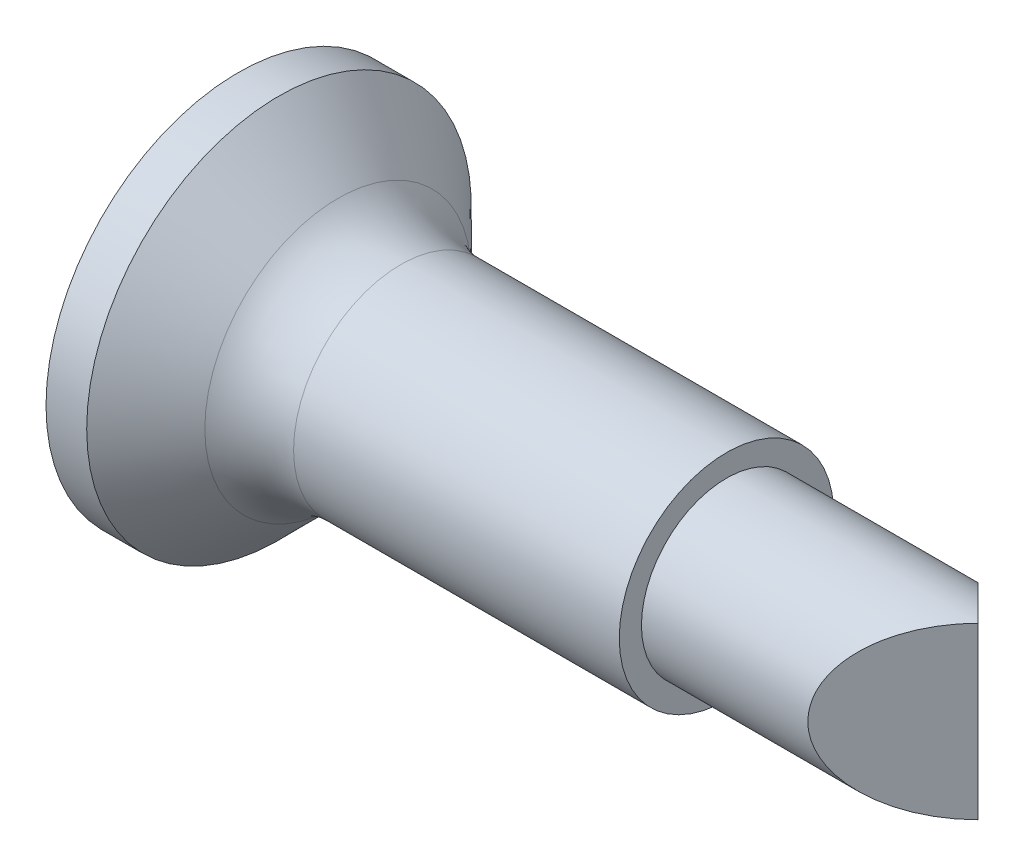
ISO-10303-21;
HEADER;
FILE_DESCRIPTION(('STEP AP214'),'2;1');
FILE_NAME('part.step','',(''),(''),'','','');
FILE_SCHEMA(('AUTOMOTIVE_DESIGN { 1 0 10303 214 1 1 1 1 }'));
ENDSEC;
DATA;
#1=APPLICATION_CONTEXT('core data for automotive mechanical design processes');
#2=APPLICATION_PROTOCOL_DEFINITION('international standard','automotive_design',2000,#1);
#3=PRODUCT_CONTEXT('',#1,'mechanical');
#4=PRODUCT('Part','Part','',(#3));
#5=PRODUCT_RELATED_PRODUCT_CATEGORY('part','',(#4));
#6=PRODUCT_DEFINITION_FORMATION('','',#4);
#7=PRODUCT_DEFINITION_CONTEXT('part definition',#1,'design');
#8=PRODUCT_DEFINITION('design','',#6,#7);
#9=PRODUCT_DEFINITION_SHAPE('','',#8);
#10=(LENGTH_UNIT() NAMED_UNIT(*) SI_UNIT(.MILLI.,.METRE.));
#11=(NAMED_UNIT(*) PLANE_ANGLE_UNIT() SI_UNIT($,.RADIAN.));
#12=(NAMED_UNIT(*) SI_UNIT($,.STERADIAN.) SOLID_ANGLE_UNIT());
#13=UNCERTAINTY_MEASURE_WITH_UNIT(LENGTH_MEASURE(1.E-05),#10,'distance_accuracy_value','');
#14=(GEOMETRIC_REPRESENTATION_CONTEXT(3) GLOBAL_UNCERTAINTY_ASSIGNED_CONTEXT((#13)) GLOBAL_UNIT_ASSIGNED_CONTEXT((#10,
#11,#12)) REPRESENTATION_CONTEXT('',''));
#15=CARTESIAN_POINT('',(0.,0.,0.));
#16=DIRECTION('',(0.,0.,1.));
#17=DIRECTION('',(1.,0.,0.));
#18=AXIS2_PLACEMENT_3D('',#15,#16,#17);
#19=CARTESIAN_POINT('',(0.,0.,0.));
#20=DIRECTION('',(1.,0.,0.));
#21=DIRECTION('',(0.,0.,-1.));
#22=AXIS2_PLACEMENT_3D('',#19,#20,#21);
#23=PLANE('',#22);
#24=CARTESIAN_POINT('',(0.,0.,0.));
#25=DIRECTION('',(-1.,0.,0.));
#26=DIRECTION('',(0.,0.,1.));
#27=AXIS2_PLACEMENT_3D('',#24,#25,#26);
#28=CIRCLE('',#27,2.6);
#29=CARTESIAN_POINT('',(0.,0.,2.6));
#30=VERTEX_POINT('',#29);
#31=EDGE_CURVE('E190',#30,#30,#28,.T.);
#32=ORIENTED_EDGE('',*,*,#31,.T.);
#33=EDGE_LOOP('',(#32));
#34=FACE_BOUND('',#33,.T.);
#35=DIRECTION('',(0.,-1.,0.));
#36=VECTOR('',#35,1.);
#37=CARTESIAN_POINT('',(0.,0.32,0.32));
#38=LINE('',#37,#36);
#39=CARTESIAN_POINT('',(0.,1.6,0.32));
#40=VERTEX_POINT('',#39);
#41=CARTESIAN_POINT('',(0.,0.64,0.32));
#42=VERTEX_POINT('',#41);
#43=EDGE_CURVE('E227',#40,#42,#38,.T.);
#44=ORIENTED_EDGE('',*,*,#43,.T.);
#45=CARTESIAN_POINT('',(0.,0.64,0.64));
#46=DIRECTION('',(1.,0.,0.));
#47=DIRECTION('',(0.,0.,-1.));
#48=AXIS2_PLACEMENT_3D('',#45,#46,#47);
#49=CIRCLE('',#48,0.32);
#50=CARTESIAN_POINT('',(0.,0.32,0.64));
#51=VERTEX_POINT('',#50);
#52=EDGE_CURVE('E169',#42,#51,#49,.F.);
#53=ORIENTED_EDGE('',*,*,#52,.T.);
#54=DIRECTION('',(0.,0.,1.));
#55=VECTOR('',#54,1.);
#56=CARTESIAN_POINT('',(0.,0.32,0.32));
#57=LINE('',#56,#55);
#58=CARTESIAN_POINT('',(0.,0.32,1.6));
#59=VERTEX_POINT('',#58);
#60=EDGE_CURVE('E224',#51,#59,#57,.T.);
#61=ORIENTED_EDGE('',*,*,#60,.T.);
#62=DIRECTION('',(0.,-1.,0.));
#63=VECTOR('',#62,1.);
#64=CARTESIAN_POINT('',(0.,0.32,1.6));
#65=LINE('',#64,#63);
#66=CARTESIAN_POINT('',(0.,-0.32,1.6));
#67=VERTEX_POINT('',#66);
#68=EDGE_CURVE('E221',#59,#67,#65,.T.);
#69=ORIENTED_EDGE('',*,*,#68,.T.);
#70=DIRECTION('',(0.,0.,-1.));
#71=VECTOR('',#70,1.);
#72=CARTESIAN_POINT('',(0.,-0.32,0.32));
#73=LINE('',#72,#71);
#74=CARTESIAN_POINT('',(0.,-0.32,0.64));
#75=VERTEX_POINT('',#74);
#76=EDGE_CURVE('E218',#67,#75,#73,.T.);
#77=ORIENTED_EDGE('',*,*,#76,.T.);
#78=CARTESIAN_POINT('',(0.,-0.64,0.64));
#79=DIRECTION('',(1.,0.,0.));
#80=DIRECTION('',(0.,0.,-1.));
#81=AXIS2_PLACEMENT_3D('',#78,#79,#80);
#82=CIRCLE('',#81,0.32);
#83=CARTESIAN_POINT('',(0.,-0.64,0.32));
#84=VERTEX_POINT('',#83);
#85=EDGE_CURVE('E172',#75,#84,#82,.F.);
#86=ORIENTED_EDGE('',*,*,#85,.T.);
#87=DIRECTION('',(0.,-1.,0.));
#88=VECTOR('',#87,1.);
#89=CARTESIAN_POINT('',(0.,-1.6,0.32));
#90=LINE('',#89,#88);
#91=CARTESIAN_POINT('',(0.,-1.6,0.32));
#92=VERTEX_POINT('',#91);
#93=EDGE_CURVE('E215',#84,#92,#90,.T.);
#94=ORIENTED_EDGE('',*,*,#93,.T.);
#95=DIRECTION('',(0.,0.,-1.));
#96=VECTOR('',#95,1.);
#97=CARTESIAN_POINT('',(0.,-1.6,-0.32));
#98=LINE('',#97,#96);
#99=CARTESIAN_POINT('',(0.,-1.6,-0.32));
#100=VERTEX_POINT('',#99);
#101=EDGE_CURVE('E211',#92,#100,#98,.T.);
#102=ORIENTED_EDGE('',*,*,#101,.T.);
#103=DIRECTION('',(0.,1.,0.));
#104=VECTOR('',#103,1.);
#105=CARTESIAN_POINT('',(0.,-1.6,-0.32));
#106=LINE('',#105,#104);
#107=CARTESIAN_POINT('',(0.,-0.64,-0.32));
#108=VERTEX_POINT('',#107);
#109=EDGE_CURVE('E243',#100,#108,#106,.T.);
#110=ORIENTED_EDGE('',*,*,#109,.T.);
#111=CARTESIAN_POINT('',(0.,-0.64,-0.64));
#112=DIRECTION('',(1.,0.,0.));
#113=DIRECTION('',(0.,0.,-1.));
#114=AXIS2_PLACEMENT_3D('',#111,#112,#113);
#115=CIRCLE('',#114,0.32);
#116=CARTESIAN_POINT('',(0.,-0.32,-0.64));
#117=VERTEX_POINT('',#116);
#118=EDGE_CURVE('E178',#108,#117,#115,.F.);
#119=ORIENTED_EDGE('',*,*,#118,.T.);
#120=DIRECTION('',(0.,0.,-1.));
#121=VECTOR('',#120,1.);
#122=CARTESIAN_POINT('',(0.,-0.32,-1.6));
#123=LINE('',#122,#121);
#124=CARTESIAN_POINT('',(0.,-0.32,-1.6));
#125=VERTEX_POINT('',#124);
#126=EDGE_CURVE('E240',#117,#125,#123,.T.);
#127=ORIENTED_EDGE('',*,*,#126,.T.);
#128=DIRECTION('',(0.,1.,0.));
#129=VECTOR('',#128,1.);
#130=CARTESIAN_POINT('',(0.,0.32,-1.6));
#131=LINE('',#130,#129);
#132=CARTESIAN_POINT('',(0.,0.32,-1.6));
#133=VERTEX_POINT('',#132);
#134=EDGE_CURVE('E237',#125,#133,#131,.T.);
#135=ORIENTED_EDGE('',*,*,#134,.T.);
#136=DIRECTION('',(0.,0.,1.));
#137=VECTOR('',#136,1.);
#138=CARTESIAN_POINT('',(0.,0.32,-1.6));
#139=LINE('',#138,#137);
#140=CARTESIAN_POINT('',(0.,0.32,-0.64));
#141=VERTEX_POINT('',#140);
#142=EDGE_CURVE('E234',#133,#141,#139,.T.);
#143=ORIENTED_EDGE('',*,*,#142,.T.);
#144=CARTESIAN_POINT('',(0.,0.64,-0.64));
#145=DIRECTION('',(1.,0.,0.));
#146=DIRECTION('',(0.,0.,-1.));
#147=AXIS2_PLACEMENT_3D('',#144,#145,#146);
#148=CIRCLE('',#147,0.32);
#149=CARTESIAN_POINT('',(0.,0.64,-0.32));
#150=VERTEX_POINT('',#149);
#151=EDGE_CURVE('E175',#141,#150,#148,.F.);
#152=ORIENTED_EDGE('',*,*,#151,.T.);
#153=DIRECTION('',(0.,1.,0.));
#154=VECTOR('',#153,1.);
#155=CARTESIAN_POINT('',(0.,0.32,-0.32));
#156=LINE('',#155,#154);
#157=CARTESIAN_POINT('',(0.,1.6,-0.32));
#158=VERTEX_POINT('',#157);
#159=EDGE_CURVE('E231',#150,#158,#156,.T.);
#160=ORIENTED_EDGE('',*,*,#159,.T.);
#161=DIRECTION('',(0.,0.,1.));
#162=VECTOR('',#161,1.);
#163=CARTESIAN_POINT('',(0.,1.6,-0.32));
#164=LINE('',#163,#162);
#165=EDGE_CURVE('E106',#158,#40,#164,.T.);
#166=ORIENTED_EDGE('',*,*,#165,.T.);
#167=EDGE_LOOP('',(#44,#53,#61,#69,#77,#86,#94,#102,#110,#119,#127,#135,#143,#152,#160,#166));
#168=FACE_BOUND('',#167,.T.);
#169=ADVANCED_FACE('F36',(#34,#168),#23,.F.);
#170=CARTESIAN_POINT('',(-9.54298563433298,0.,0.));
#171=DIRECTION('',(-1.,0.,0.));
#172=DIRECTION('',(0.,0.,1.));
#173=AXIS2_PLACEMENT_3D('',#170,#171,#172);
#174=CYLINDRICAL_SURFACE('',#173,2.6);
#175=ORIENTED_EDGE('',*,*,#31,.F.);
#176=EDGE_LOOP('',(#175));
#177=FACE_BOUND('',#176,.T.);
#178=CARTESIAN_POINT('',(0.550000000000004,0.,0.));
#179=DIRECTION('',(-1.,0.,0.));
#180=DIRECTION('',(0.,0.,1.));
#181=AXIS2_PLACEMENT_3D('',#178,#179,#180);
#182=CIRCLE('',#181,2.6);
#183=CARTESIAN_POINT('',(0.550000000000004,0.,2.6));
#184=VERTEX_POINT('',#183);
#185=EDGE_CURVE('E193',#184,#184,#182,.T.);
#186=ORIENTED_EDGE('',*,*,#185,.T.);
#187=EDGE_LOOP('',(#186));
#188=FACE_BOUND('',#187,.T.);
#189=ADVANCED_FACE('F370',(#177,#188),#174,.T.);
#190=CARTESIAN_POINT('',(1.7,0.,0.));
#191=DIRECTION('',(-1.,0.,0.));
#192=DIRECTION('',(0.,0.,1.));
#193=AXIS2_PLACEMENT_3D('',#190,#191,#192);
#194=CONICAL_SURFACE('',#193,1.45,0.78539816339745);
#195=CARTESIAN_POINT('',(1.34852813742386,0.,0.));
#196=DIRECTION('',(-1.,0.,0.));
#197=DIRECTION('',(0.,0.,1.));
#198=AXIS2_PLACEMENT_3D('',#195,#196,#197);
#199=CIRCLE('',#198,1.80147186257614);
#200=CARTESIAN_POINT('',(1.34852813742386,0.,1.80147186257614));
#201=VERTEX_POINT('',#200);
#202=EDGE_CURVE('E187',#201,#201,#199,.T.);
#203=ORIENTED_EDGE('',*,*,#202,.T.);
#204=EDGE_LOOP('',(#203));
#205=FACE_BOUND('',#204,.T.);
#206=ORIENTED_EDGE('',*,*,#185,.F.);
#207=EDGE_LOOP('',(#206));
#208=FACE_BOUND('',#207,.T.);
#209=ADVANCED_FACE('F376',(#205,#208),#194,.T.);
#210=CARTESIAN_POINT('',(-9.54298563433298,0.,0.));
#211=DIRECTION('',(-1.,0.,0.));
#212=DIRECTION('',(0.,0.,1.));
#213=AXIS2_PLACEMENT_3D('',#210,#211,#212);
#214=CYLINDRICAL_SURFACE('',#213,1.45);
#215=CARTESIAN_POINT('',(2.19705627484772,0.,0.));
#216=DIRECTION('',(-1.,0.,0.));
#217=DIRECTION('',(0.,0.,1.));
#218=AXIS2_PLACEMENT_3D('',#215,#216,#217);
#219=CIRCLE('',#218,1.45);
#220=CARTESIAN_POINT('',(2.19705627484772,0.,1.45));
#221=VERTEX_POINT('',#220);
#222=EDGE_CURVE('E184',#221,#221,#219,.F.);
#223=ORIENTED_EDGE('',*,*,#222,.T.);
#224=EDGE_LOOP('',(#223));
#225=FACE_BOUND('',#224,.T.);
#226=CARTESIAN_POINT('',(6.6,0.,0.));
#227=DIRECTION('',(-1.,0.,0.));
#228=DIRECTION('',(0.,0.,1.));
#229=AXIS2_PLACEMENT_3D('',#226,#227,#228);
#230=CIRCLE('',#229,1.45);
#231=CARTESIAN_POINT('',(6.6,0.,1.45));
#232=VERTEX_POINT('',#231);
#233=EDGE_CURVE('E197',#232,#232,#230,.T.);
#234=ORIENTED_EDGE('',*,*,#233,.T.);
#235=EDGE_LOOP('',(#234));
#236=FACE_BOUND('',#235,.T.);
#237=ADVANCED_FACE('F426',(#225,#236),#214,.T.);
#238=CARTESIAN_POINT('',(6.6,1.45,0.));
#239=DIRECTION('',(-1.,0.,0.));
#240=DIRECTION('',(0.,0.,1.));
#241=AXIS2_PLACEMENT_3D('',#238,#239,#240);
#242=PLANE('',#241);
#243=ORIENTED_EDGE('',*,*,#233,.F.);
#244=EDGE_LOOP('',(#243));
#245=FACE_BOUND('',#244,.T.);
#246=CARTESIAN_POINT('',(6.6,0.,0.));
#247=DIRECTION('',(-1.,0.,0.));
#248=DIRECTION('',(0.,0.,1.));
#249=AXIS2_PLACEMENT_3D('',#246,#247,#248);
#250=CIRCLE('',#249,1.15);
#251=CARTESIAN_POINT('',(6.6,0.,1.15));
#252=VERTEX_POINT('',#251);
#253=EDGE_CURVE('E200',#252,#252,#250,.T.);
#254=ORIENTED_EDGE('',*,*,#253,.T.);
#255=EDGE_LOOP('',(#254));
#256=FACE_BOUND('',#255,.T.);
#257=ADVANCED_FACE('F422',(#245,#256),#242,.F.);
#258=CARTESIAN_POINT('',(-9.54298563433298,0.,0.));
#259=DIRECTION('',(-1.,0.,0.));
#260=DIRECTION('',(0.,0.,1.));
#261=AXIS2_PLACEMENT_3D('',#258,#259,#260);
#262=CYLINDRICAL_SURFACE('',#261,1.15);
#263=ORIENTED_EDGE('',*,*,#253,.F.);
#264=EDGE_LOOP('',(#263));
#265=FACE_BOUND('',#264,.T.);
#266=CARTESIAN_POINT('',(9.99999999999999,0.,0.));
#267=DIRECTION('',(-0.707106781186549,0.,0.707106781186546));
#268=DIRECTION('',(-0.707106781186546,0.,-0.707106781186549));
#269=AXIS2_PLACEMENT_3D('',#266,#267,#268);
#270=ELLIPSE('',#269,1.62634559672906,1.15);
#271=CARTESIAN_POINT('',(9.99999999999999,1.15,0.));
#272=VERTEX_POINT('',#271);
#273=CARTESIAN_POINT('',(10.,-1.15,0.));
#274=VERTEX_POINT('',#273);
#275=EDGE_CURVE('E206',#272,#274,#270,.T.);
#276=ORIENTED_EDGE('',*,*,#275,.T.);
#277=CARTESIAN_POINT('',(9.99999999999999,0.,0.));
#278=DIRECTION('',(-0.707106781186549,0.,-0.707106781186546));
#279=DIRECTION('',(-0.707106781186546,0.,0.707106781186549));
#280=AXIS2_PLACEMENT_3D('',#277,#278,#279);
#281=ELLIPSE('',#280,1.62634559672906,1.15);
#282=EDGE_CURVE('E203',#274,#272,#281,.T.);
#283=ORIENTED_EDGE('',*,*,#282,.T.);
#284=EDGE_LOOP('',(#276,#283));
#285=FACE_BOUND('',#284,.T.);
#286=ADVANCED_FACE('F385',(#265,#285),#262,.T.);
#287=CARTESIAN_POINT('',(2.19705627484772,0.,0.));
#288=DIRECTION('',(-1.,0.,0.));
#289=DIRECTION('',(0.,0.,1.));
#290=AXIS2_PLACEMENT_3D('',#287,#288,#289);
#291=TOROIDAL_SURFACE('',#290,2.65,1.2);
#292=ORIENTED_EDGE('',*,*,#222,.F.);
#293=EDGE_LOOP('',(#292));
#294=FACE_BOUND('',#293,.T.);
#295=ORIENTED_EDGE('',*,*,#202,.F.);
#296=EDGE_LOOP('',(#295));
#297=FACE_BOUND('',#296,.T.);
#298=ADVANCED_FACE('F381',(#294,#297),#291,.F.);
#299=CARTESIAN_POINT('',(0.,-2.6,10.));
#300=DIRECTION('',(-0.707106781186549,0.,-0.707106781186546));
#301=DIRECTION('',(-0.707106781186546,0.,0.707106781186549));
#302=AXIS2_PLACEMENT_3D('',#299,#300,#301);
#303=PLANE('',#302);
#304=DIRECTION('',(0.,1.,0.));
#305=VECTOR('',#304,1.);
#306=CARTESIAN_POINT('',(9.99999999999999,-2.6,0.));
#307=LINE('',#306,#305);
#308=EDGE_CURVE('E133',#274,#272,#307,.T.);
#309=ORIENTED_EDGE('',*,*,#308,.T.);
#310=ORIENTED_EDGE('',*,*,#282,.F.);
#311=EDGE_LOOP('',(#309,#310));
#312=FACE_BOUND('',#311,.T.);
#313=ADVANCED_FACE('F384',(#312),#303,.F.);
#314=CARTESIAN_POINT('',(0.,-2.6,-10.));
#315=DIRECTION('',(-0.707106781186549,0.,0.707106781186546));
#316=DIRECTION('',(0.707106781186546,0.,0.707106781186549));
#317=AXIS2_PLACEMENT_3D('',#314,#315,#316);
#318=PLANE('',#317);
#319=ORIENTED_EDGE('',*,*,#308,.F.);
#320=ORIENTED_EDGE('',*,*,#275,.F.);
#321=EDGE_LOOP('',(#319,#320));
#322=FACE_BOUND('',#321,.T.);
#323=ADVANCED_FACE('F413',(#322),#318,.F.);
#324=CARTESIAN_POINT('',(0.566666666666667,-1.6,-0.32));
#325=DIRECTION('',(0.,0.,1.));
#326=DIRECTION('',(1.,0.,0.));
#327=AXIS2_PLACEMENT_3D('',#324,#325,#326);
#328=PLANE('',#327);
#329=DIRECTION('',(0.,1.,0.));
#330=VECTOR('',#329,1.);
#331=CARTESIAN_POINT('',(0.566666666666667,-1.6,-0.32));
#332=LINE('',#331,#330);
#333=CARTESIAN_POINT('',(0.566666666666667,-1.33575899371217,-0.32));
#334=VERTEX_POINT('',#333);
#335=CARTESIAN_POINT('',(0.566666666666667,-0.64,-0.32));
#336=VERTEX_POINT('',#335);
#337=EDGE_CURVE('E214',#334,#336,#332,.T.);
#338=ORIENTED_EDGE('',*,*,#337,.T.);
#339=DIRECTION('',(-1.,0.,0.));
#340=VECTOR('',#339,1.);
#341=CARTESIAN_POINT('',(0.566666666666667,-0.64,-0.32));
#342=LINE('',#341,#340);
#343=EDGE_CURVE('E153',#336,#108,#342,.T.);
#344=ORIENTED_EDGE('',*,*,#343,.T.);
#345=ORIENTED_EDGE('',*,*,#109,.F.);
#346=DIRECTION('',(-0.90630778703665,-0.4226182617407,0.));
#347=VECTOR('',#346,1.);
#348=CARTESIAN_POINT('',(0.465456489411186,-1.38295407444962,-0.32));
#349=LINE('',#348,#347);
#350=EDGE_CURVE('E124',#334,#100,#349,.T.);
#351=ORIENTED_EDGE('',*,*,#350,.F.);
#352=EDGE_LOOP('',(#338,#344,#345,#351));
#353=FACE_BOUND('',#352,.T.);
#354=ADVANCED_FACE('F257',(#353),#328,.T.);
#355=CARTESIAN_POINT('',(0.566666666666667,-0.32,-1.6));
#356=DIRECTION('',(0.,1.,0.));
#357=DIRECTION('',(0.,0.,1.));
#358=AXIS2_PLACEMENT_3D('',#355,#356,#357);
#359=PLANE('',#358);
#360=ORIENTED_EDGE('',*,*,#126,.F.);
#361=DIRECTION('',(-1.,0.,0.));
#362=VECTOR('',#361,1.);
#363=CARTESIAN_POINT('',(0.566666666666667,-0.32,-0.64));
#364=LINE('',#363,#362);
#365=CARTESIAN_POINT('',(0.566666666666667,-0.32,-0.64));
#366=VERTEX_POINT('',#365);
#367=EDGE_CURVE('E55',#117,#366,#364,.F.);
#368=ORIENTED_EDGE('',*,*,#367,.T.);
#369=DIRECTION('',(0.,0.,-1.));
#370=VECTOR('',#369,1.);
#371=CARTESIAN_POINT('',(0.566666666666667,-0.32,-1.6));
#372=LINE('',#371,#370);
#373=CARTESIAN_POINT('',(0.566666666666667,-0.32,-1.33575899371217));
#374=VERTEX_POINT('',#373);
#375=EDGE_CURVE('E136',#366,#374,#372,.T.);
#376=ORIENTED_EDGE('',*,*,#375,.T.);
#377=DIRECTION('',(-0.90630778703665,0.,-0.4226182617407));
#378=VECTOR('',#377,1.);
#379=CARTESIAN_POINT('',(0.,-0.32,-1.6));
#380=LINE('',#379,#378);
#381=EDGE_CURVE('E130',#374,#125,#380,.T.);
#382=ORIENTED_EDGE('',*,*,#381,.T.);
#383=EDGE_LOOP('',(#360,#368,#376,#382));
#384=FACE_BOUND('',#383,.T.);
#385=ADVANCED_FACE('F272',(#384),#359,.T.);
#386=CARTESIAN_POINT('',(0.,0.32,-1.6));
#387=DIRECTION('',(-0.4226182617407,0.,0.906307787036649));
#388=DIRECTION('',(0.90630778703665,0.,0.4226182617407));
#389=AXIS2_PLACEMENT_3D('',#386,#387,#388);
#390=PLANE('',#389);
#391=ORIENTED_EDGE('',*,*,#134,.F.);
#392=ORIENTED_EDGE('',*,*,#381,.F.);
#393=DIRECTION('',(0.,1.,0.));
#394=VECTOR('',#393,1.);
#395=CARTESIAN_POINT('',(0.566666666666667,0.32,-1.33575899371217));
#396=LINE('',#395,#394);
#397=CARTESIAN_POINT('',(0.566666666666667,0.32,-1.33575899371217));
#398=VERTEX_POINT('',#397);
#399=EDGE_CURVE('E134',#374,#398,#396,.T.);
#400=ORIENTED_EDGE('',*,*,#399,.T.);
#401=DIRECTION('',(-0.90630778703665,0.,-0.4226182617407));
#402=VECTOR('',#401,1.);
#403=CARTESIAN_POINT('',(0.465456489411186,0.32,-1.38295407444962));
#404=LINE('',#403,#402);
#405=EDGE_CURVE('E107',#398,#133,#404,.T.);
#406=ORIENTED_EDGE('',*,*,#405,.T.);
#407=EDGE_LOOP('',(#391,#392,#400,#406));
#408=FACE_BOUND('',#407,.T.);
#409=ADVANCED_FACE('F38',(#408),#390,.T.);
#410=CARTESIAN_POINT('',(0.566666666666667,0.32,-1.6));
#411=DIRECTION('',(0.,-1.,0.));
#412=DIRECTION('',(0.,0.,-1.));
#413=AXIS2_PLACEMENT_3D('',#410,#411,#412);
#414=PLANE('',#413);
#415=DIRECTION('',(0.,0.,1.));
#416=VECTOR('',#415,1.);
#417=CARTESIAN_POINT('',(0.566666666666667,0.32,-1.6));
#418=LINE('',#417,#416);
#419=CARTESIAN_POINT('',(0.566666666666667,0.32,-0.64));
#420=VERTEX_POINT('',#419);
#421=EDGE_CURVE('E102',#398,#420,#418,.T.);
#422=ORIENTED_EDGE('',*,*,#421,.T.);
#423=DIRECTION('',(-1.,0.,0.));
#424=VECTOR('',#423,1.);
#425=CARTESIAN_POINT('',(0.566666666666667,0.32,-0.64));
#426=LINE('',#425,#424);
#427=EDGE_CURVE('E157',#420,#141,#426,.T.);
#428=ORIENTED_EDGE('',*,*,#427,.T.);
#429=ORIENTED_EDGE('',*,*,#142,.F.);
#430=ORIENTED_EDGE('',*,*,#405,.F.);
#431=EDGE_LOOP('',(#422,#428,#429,#430));
#432=FACE_BOUND('',#431,.T.);
#433=ADVANCED_FACE('F324',(#432),#414,.T.);
#434=CARTESIAN_POINT('',(0.566666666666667,0.32,-0.32));
#435=DIRECTION('',(0.,0.,1.));
#436=DIRECTION('',(0.,-1.,0.));
#437=AXIS2_PLACEMENT_3D('',#434,#435,#436);
#438=PLANE('',#437);
#439=ORIENTED_EDGE('',*,*,#159,.F.);
#440=DIRECTION('',(-1.,0.,0.));
#441=VECTOR('',#440,1.);
#442=CARTESIAN_POINT('',(0.566666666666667,0.64,-0.32));
#443=LINE('',#442,#441);
#444=CARTESIAN_POINT('',(0.566666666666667,0.64,-0.32));
#445=VERTEX_POINT('',#444);
#446=EDGE_CURVE('E98',#150,#445,#443,.F.);
#447=ORIENTED_EDGE('',*,*,#446,.T.);
#448=DIRECTION('',(0.,1.,0.));
#449=VECTOR('',#448,1.);
#450=CARTESIAN_POINT('',(0.566666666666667,0.32,-0.32));
#451=LINE('',#450,#449);
#452=CARTESIAN_POINT('',(0.566666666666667,1.33575899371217,-0.32));
#453=VERTEX_POINT('',#452);
#454=EDGE_CURVE('E92',#445,#453,#451,.T.);
#455=ORIENTED_EDGE('',*,*,#454,.T.);
#456=DIRECTION('',(-0.90630778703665,0.4226182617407,0.));
#457=VECTOR('',#456,1.);
#458=CARTESIAN_POINT('',(0.,1.6,-0.32));
#459=LINE('',#458,#457);
#460=EDGE_CURVE('E40',#453,#158,#459,.T.);
#461=ORIENTED_EDGE('',*,*,#460,.T.);
#462=EDGE_LOOP('',(#439,#447,#455,#461));
#463=FACE_BOUND('',#462,.T.);
#464=ADVANCED_FACE('F94',(#463),#438,.T.);
#465=CARTESIAN_POINT('',(0.,1.6,-0.32));
#466=DIRECTION('',(-0.4226182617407,-0.906307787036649,0.));
#467=DIRECTION('',(0.90630778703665,-0.4226182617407,0.));
#468=AXIS2_PLACEMENT_3D('',#465,#466,#467);
#469=PLANE('',#468);
#470=ORIENTED_EDGE('',*,*,#165,.F.);
#471=ORIENTED_EDGE('',*,*,#460,.F.);
#472=DIRECTION('',(0.,0.,1.));
#473=VECTOR('',#472,1.);
#474=CARTESIAN_POINT('',(0.566666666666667,1.33575899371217,-0.32));
#475=LINE('',#474,#473);
#476=CARTESIAN_POINT('',(0.566666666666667,1.33575899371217,0.32));
#477=VERTEX_POINT('',#476);
#478=EDGE_CURVE('E85',#453,#477,#475,.T.);
#479=ORIENTED_EDGE('',*,*,#478,.T.);
#480=DIRECTION('',(-0.90630778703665,0.4226182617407,0.));
#481=VECTOR('',#480,1.);
#482=CARTESIAN_POINT('',(0.955724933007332,1.15433814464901,0.32));
#483=LINE('',#482,#481);
#484=EDGE_CURVE('E108',#477,#40,#483,.T.);
#485=ORIENTED_EDGE('',*,*,#484,.T.);
#486=EDGE_LOOP('',(#470,#471,#479,#485));
#487=FACE_BOUND('',#486,.T.);
#488=ADVANCED_FACE('F104',(#487),#469,.T.);
#489=CARTESIAN_POINT('',(0.566666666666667,0.32,0.32));
#490=DIRECTION('',(0.,0.,-1.));
#491=DIRECTION('',(-1.,0.,0.));
#492=AXIS2_PLACEMENT_3D('',#489,#490,#491);
#493=PLANE('',#492);
#494=DIRECTION('',(0.,-1.,0.));
#495=VECTOR('',#494,1.);
#496=CARTESIAN_POINT('',(0.566666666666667,0.32,0.32));
#497=LINE('',#496,#495);
#498=CARTESIAN_POINT('',(0.566666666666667,0.64,0.32));
#499=VERTEX_POINT('',#498);
#500=EDGE_CURVE('E114',#477,#499,#497,.T.);
#501=ORIENTED_EDGE('',*,*,#500,.T.);
#502=DIRECTION('',(-1.,0.,0.));
#503=VECTOR('',#502,1.);
#504=CARTESIAN_POINT('',(0.566666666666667,0.64,0.32));
#505=LINE('',#504,#503);
#506=EDGE_CURVE('E181',#499,#42,#505,.T.);
#507=ORIENTED_EDGE('',*,*,#506,.T.);
#508=ORIENTED_EDGE('',*,*,#43,.F.);
#509=ORIENTED_EDGE('',*,*,#484,.F.);
#510=EDGE_LOOP('',(#501,#507,#508,#509));
#511=FACE_BOUND('',#510,.T.);
#512=ADVANCED_FACE('F329',(#511),#493,.T.);
#513=CARTESIAN_POINT('',(0.566666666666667,0.32,0.32));
#514=DIRECTION('',(0.,-1.,0.));
#515=DIRECTION('',(0.,0.,-1.));
#516=AXIS2_PLACEMENT_3D('',#513,#514,#515);
#517=PLANE('',#516);
#518=ORIENTED_EDGE('',*,*,#60,.F.);
#519=DIRECTION('',(-1.,0.,0.));
#520=VECTOR('',#519,1.);
#521=CARTESIAN_POINT('',(0.566666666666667,0.32,0.64));
#522=LINE('',#521,#520);
#523=CARTESIAN_POINT('',(0.566666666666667,0.32,0.64));
#524=VERTEX_POINT('',#523);
#525=EDGE_CURVE('E166',#51,#524,#522,.F.);
#526=ORIENTED_EDGE('',*,*,#525,.T.);
#527=DIRECTION('',(0.,0.,1.));
#528=VECTOR('',#527,1.);
#529=CARTESIAN_POINT('',(0.566666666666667,0.32,0.32));
#530=LINE('',#529,#528);
#531=CARTESIAN_POINT('',(0.566666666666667,0.32,1.33575899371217));
#532=VERTEX_POINT('',#531);
#533=EDGE_CURVE('E115',#524,#532,#530,.T.);
#534=ORIENTED_EDGE('',*,*,#533,.T.);
#535=DIRECTION('',(-0.90630778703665,0.,0.4226182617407));
#536=VECTOR('',#535,1.);
#537=CARTESIAN_POINT('',(0.,0.32,1.6));
#538=LINE('',#537,#536);
#539=EDGE_CURVE('E119',#532,#59,#538,.T.);
#540=ORIENTED_EDGE('',*,*,#539,.T.);
#541=EDGE_LOOP('',(#518,#526,#534,#540));
#542=FACE_BOUND('',#541,.T.);
#543=ADVANCED_FACE('F337',(#542),#517,.T.);
#544=CARTESIAN_POINT('',(0.,0.32,1.6));
#545=DIRECTION('',(-0.4226182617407,0.,-0.90630778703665));
#546=DIRECTION('',(-0.90630778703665,0.,0.4226182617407));
#547=AXIS2_PLACEMENT_3D('',#544,#545,#546);
#548=PLANE('',#547);
#549=ORIENTED_EDGE('',*,*,#68,.F.);
#550=ORIENTED_EDGE('',*,*,#539,.F.);
#551=DIRECTION('',(0.,-1.,0.));
#552=VECTOR('',#551,1.);
#553=CARTESIAN_POINT('',(0.566666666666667,0.32,1.33575899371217));
#554=LINE('',#553,#552);
#555=CARTESIAN_POINT('',(0.566666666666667,-0.32,1.33575899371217));
#556=VERTEX_POINT('',#555);
#557=EDGE_CURVE('E141',#532,#556,#554,.T.);
#558=ORIENTED_EDGE('',*,*,#557,.T.);
#559=DIRECTION('',(-0.90630778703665,0.,0.4226182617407));
#560=VECTOR('',#559,1.);
#561=CARTESIAN_POINT('',(0.955724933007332,-0.32,1.15433814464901));
#562=LINE('',#561,#560);
#563=EDGE_CURVE('E123',#556,#67,#562,.T.);
#564=ORIENTED_EDGE('',*,*,#563,.T.);
#565=EDGE_LOOP('',(#549,#550,#558,#564));
#566=FACE_BOUND('',#565,.T.);
#567=ADVANCED_FACE('F344',(#566),#548,.T.);
#568=CARTESIAN_POINT('',(0.566666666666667,-0.32,0.32));
#569=DIRECTION('',(0.,1.,0.));
#570=DIRECTION('',(0.,0.,1.));
#571=AXIS2_PLACEMENT_3D('',#568,#569,#570);
#572=PLANE('',#571);
#573=DIRECTION('',(0.,0.,-1.));
#574=VECTOR('',#573,1.);
#575=CARTESIAN_POINT('',(0.566666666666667,-0.32,0.32));
#576=LINE('',#575,#574);
#577=CARTESIAN_POINT('',(0.566666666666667,-0.32,0.64));
#578=VERTEX_POINT('',#577);
#579=EDGE_CURVE('E143',#556,#578,#576,.T.);
#580=ORIENTED_EDGE('',*,*,#579,.T.);
#581=DIRECTION('',(-1.,0.,0.));
#582=VECTOR('',#581,1.);
#583=CARTESIAN_POINT('',(0.566666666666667,-0.32,0.64));
#584=LINE('',#583,#582);
#585=EDGE_CURVE('E163',#578,#75,#584,.T.);
#586=ORIENTED_EDGE('',*,*,#585,.T.);
#587=ORIENTED_EDGE('',*,*,#76,.F.);
#588=ORIENTED_EDGE('',*,*,#563,.F.);
#589=EDGE_LOOP('',(#580,#586,#587,#588));
#590=FACE_BOUND('',#589,.T.);
#591=ADVANCED_FACE('F347',(#590),#572,.T.);
#592=CARTESIAN_POINT('',(0.566666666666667,-1.6,0.32));
#593=DIRECTION('',(0.,0.,-1.));
#594=DIRECTION('',(-1.,0.,0.));
#595=AXIS2_PLACEMENT_3D('',#592,#593,#594);
#596=PLANE('',#595);
#597=ORIENTED_EDGE('',*,*,#93,.F.);
#598=DIRECTION('',(-1.,0.,0.));
#599=VECTOR('',#598,1.);
#600=CARTESIAN_POINT('',(0.566666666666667,-0.64,0.32));
#601=LINE('',#600,#599);
#602=CARTESIAN_POINT('',(0.566666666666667,-0.64,0.32));
#603=VERTEX_POINT('',#602);
#604=EDGE_CURVE('E160',#84,#603,#601,.F.);
#605=ORIENTED_EDGE('',*,*,#604,.T.);
#606=DIRECTION('',(0.,-1.,0.));
#607=VECTOR('',#606,1.);
#608=CARTESIAN_POINT('',(0.566666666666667,-1.6,0.32));
#609=LINE('',#608,#607);
#610=CARTESIAN_POINT('',(0.566666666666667,-1.33575899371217,0.32));
#611=VERTEX_POINT('',#610);
#612=EDGE_CURVE('E127',#603,#611,#609,.T.);
#613=ORIENTED_EDGE('',*,*,#612,.T.);
#614=DIRECTION('',(-0.90630778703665,-0.4226182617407,0.));
#615=VECTOR('',#614,1.);
#616=CARTESIAN_POINT('',(0.,-1.6,0.32));
#617=LINE('',#616,#615);
#618=EDGE_CURVE('E120',#611,#92,#617,.T.);
#619=ORIENTED_EDGE('',*,*,#618,.T.);
#620=EDGE_LOOP('',(#597,#605,#613,#619));
#621=FACE_BOUND('',#620,.T.);
#622=ADVANCED_FACE('F353',(#621),#596,.T.);
#623=CARTESIAN_POINT('',(0.,-1.6,-0.32));
#624=DIRECTION('',(-0.4226182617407,0.90630778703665,0.));
#625=DIRECTION('',(-0.90630778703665,-0.4226182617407,0.));
#626=AXIS2_PLACEMENT_3D('',#623,#624,#625);
#627=PLANE('',#626);
#628=ORIENTED_EDGE('',*,*,#101,.F.);
#629=ORIENTED_EDGE('',*,*,#618,.F.);
#630=DIRECTION('',(0.,0.,-1.));
#631=VECTOR('',#630,1.);
#632=CARTESIAN_POINT('',(0.566666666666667,-1.33575899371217,-0.32));
#633=LINE('',#632,#631);
#634=EDGE_CURVE('E125',#611,#334,#633,.T.);
#635=ORIENTED_EDGE('',*,*,#634,.T.);
#636=ORIENTED_EDGE('',*,*,#350,.T.);
#637=EDGE_LOOP('',(#628,#629,#635,#636));
#638=FACE_BOUND('',#637,.T.);
#639=ADVANCED_FACE('F360',(#638),#627,.T.);
#640=CARTESIAN_POINT('',(0.566666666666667,1.6,-0.32));
#641=DIRECTION('',(1.,0.,0.));
#642=DIRECTION('',(0.,0.,-1.));
#643=AXIS2_PLACEMENT_3D('',#640,#641,#642);
#644=PLANE('',#643);
#645=ORIENTED_EDGE('',*,*,#337,.F.);
#646=ORIENTED_EDGE('',*,*,#634,.F.);
#647=ORIENTED_EDGE('',*,*,#612,.F.);
#648=CARTESIAN_POINT('',(0.566666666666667,-0.64,0.64));
#649=DIRECTION('',(1.,0.,0.));
#650=DIRECTION('',(0.,0.,-1.));
#651=AXIS2_PLACEMENT_3D('',#648,#649,#650);
#652=CIRCLE('',#651,0.32);
#653=EDGE_CURVE('E147',#603,#578,#652,.T.);
#654=ORIENTED_EDGE('',*,*,#653,.T.);
#655=ORIENTED_EDGE('',*,*,#579,.F.);
#656=ORIENTED_EDGE('',*,*,#557,.F.);
#657=ORIENTED_EDGE('',*,*,#533,.F.);
#658=CARTESIAN_POINT('',(0.566666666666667,0.64,0.64));
#659=DIRECTION('',(1.,0.,0.));
#660=DIRECTION('',(0.,0.,-1.));
#661=AXIS2_PLACEMENT_3D('',#658,#659,#660);
#662=CIRCLE('',#661,0.32);
#663=EDGE_CURVE('E150',#524,#499,#662,.T.);
#664=ORIENTED_EDGE('',*,*,#663,.T.);
#665=ORIENTED_EDGE('',*,*,#500,.F.);
#666=ORIENTED_EDGE('',*,*,#478,.F.);
#667=ORIENTED_EDGE('',*,*,#454,.F.);
#668=CARTESIAN_POINT('',(0.566666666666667,0.64,-0.64));
#669=DIRECTION('',(1.,0.,0.));
#670=DIRECTION('',(0.,0.,-1.));
#671=AXIS2_PLACEMENT_3D('',#668,#669,#670);
#672=CIRCLE('',#671,0.32);
#673=EDGE_CURVE('E46',#445,#420,#672,.T.);
#674=ORIENTED_EDGE('',*,*,#673,.T.);
#675=ORIENTED_EDGE('',*,*,#421,.F.);
#676=ORIENTED_EDGE('',*,*,#399,.F.);
#677=ORIENTED_EDGE('',*,*,#375,.F.);
#678=CARTESIAN_POINT('',(0.566666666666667,-0.64,-0.64));
#679=DIRECTION('',(1.,0.,0.));
#680=DIRECTION('',(0.,0.,-1.));
#681=AXIS2_PLACEMENT_3D('',#678,#679,#680);
#682=CIRCLE('',#681,0.32);
#683=EDGE_CURVE('E11',#366,#336,#682,.T.);
#684=ORIENTED_EDGE('',*,*,#683,.T.);
#685=EDGE_LOOP('',(#645,#646,#647,#654,#655,#656,#657,#664,#665,#666,#667,#674,#675,#676,#677,#684));
#686=FACE_BOUND('',#685,.T.);
#687=ADVANCED_FACE('F111',(#686),#644,.F.);
#688=CARTESIAN_POINT('',(0.566666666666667,0.64,0.64));
#689=DIRECTION('',(-1.,0.,0.));
#690=DIRECTION('',(0.,0.,1.));
#691=AXIS2_PLACEMENT_3D('',#688,#689,#690);
#692=CYLINDRICAL_SURFACE('',#691,0.32);
#693=ORIENTED_EDGE('',*,*,#663,.F.);
#694=ORIENTED_EDGE('',*,*,#525,.F.);
#695=ORIENTED_EDGE('',*,*,#52,.F.);
#696=ORIENTED_EDGE('',*,*,#506,.F.);
#697=EDGE_LOOP('',(#693,#694,#695,#696));
#698=FACE_BOUND('',#697,.T.);
#699=ADVANCED_FACE('F333',(#698),#692,.T.);
#700=CARTESIAN_POINT('',(0.566666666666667,-0.64,0.64));
#701=DIRECTION('',(-1.,0.,0.));
#702=DIRECTION('',(0.,0.,1.));
#703=AXIS2_PLACEMENT_3D('',#700,#701,#702);
#704=CYLINDRICAL_SURFACE('',#703,0.32);
#705=ORIENTED_EDGE('',*,*,#653,.F.);
#706=ORIENTED_EDGE('',*,*,#604,.F.);
#707=ORIENTED_EDGE('',*,*,#85,.F.);
#708=ORIENTED_EDGE('',*,*,#585,.F.);
#709=EDGE_LOOP('',(#705,#706,#707,#708));
#710=FACE_BOUND('',#709,.T.);
#711=ADVANCED_FACE('F358',(#710),#704,.T.);
#712=CARTESIAN_POINT('',(0.566666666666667,0.64,-0.64));
#713=DIRECTION('',(-1.,0.,0.));
#714=DIRECTION('',(0.,0.,1.));
#715=AXIS2_PLACEMENT_3D('',#712,#713,#714);
#716=CYLINDRICAL_SURFACE('',#715,0.32);
#717=ORIENTED_EDGE('',*,*,#673,.F.);
#718=ORIENTED_EDGE('',*,*,#446,.F.);
#719=ORIENTED_EDGE('',*,*,#151,.F.);
#720=ORIENTED_EDGE('',*,*,#427,.F.);
#721=EDGE_LOOP('',(#717,#718,#719,#720));
#722=FACE_BOUND('',#721,.T.);
#723=ADVANCED_FACE('F325',(#722),#716,.T.);
#724=CARTESIAN_POINT('',(0.566666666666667,-0.64,-0.64));
#725=DIRECTION('',(-1.,0.,0.));
#726=DIRECTION('',(0.,0.,1.));
#727=AXIS2_PLACEMENT_3D('',#724,#725,#726);
#728=CYLINDRICAL_SURFACE('',#727,0.32);
#729=ORIENTED_EDGE('',*,*,#683,.F.);
#730=ORIENTED_EDGE('',*,*,#367,.F.);
#731=ORIENTED_EDGE('',*,*,#118,.F.);
#732=ORIENTED_EDGE('',*,*,#343,.F.);
#733=EDGE_LOOP('',(#729,#730,#731,#732));
#734=FACE_BOUND('',#733,.T.);
#735=ADVANCED_FACE('F264',(#734),#728,.T.);
#736=CLOSED_SHELL('',(#169,#189,#209,#237,#257,#286,#298,#313,#323,#354,#385,#409,#433,#464,
#488,#512,#543,#567,#591,#622,#639,#687,#699,#711,#723,#735));
#737=MANIFOLD_SOLID_BREP('B2',#736);
#738=ADVANCED_BREP_SHAPE_REPRESENTATION('',(#18,#737),#14);
#739=SHAPE_DEFINITION_REPRESENTATION(#9,#738);
ENDSEC;
END-ISO-10303-21;
